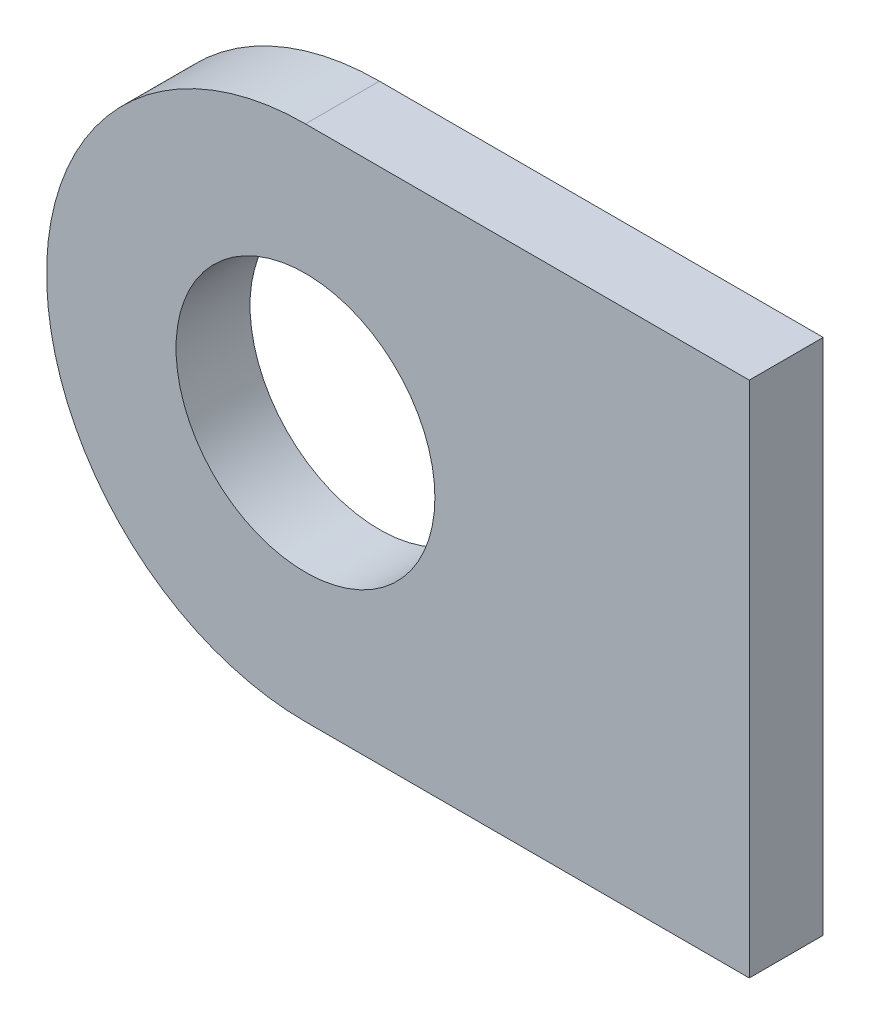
ISO-10303-21;
HEADER;
FILE_DESCRIPTION(('STEP AP214'),'2;1');
FILE_NAME('part.step','',(''),(''),'','','');
FILE_SCHEMA(('AUTOMOTIVE_DESIGN { 1 0 10303 214 1 1 1 1 }'));
ENDSEC;
DATA;
#1=APPLICATION_CONTEXT('core data for automotive mechanical design processes');
#2=APPLICATION_PROTOCOL_DEFINITION('international standard','automotive_design',2000,#1);
#3=PRODUCT_CONTEXT('',#1,'mechanical');
#4=PRODUCT('Part','Part','',(#3));
#5=PRODUCT_RELATED_PRODUCT_CATEGORY('part','',(#4));
#6=PRODUCT_DEFINITION_FORMATION('','',#4);
#7=PRODUCT_DEFINITION_CONTEXT('part definition',#1,'design');
#8=PRODUCT_DEFINITION('design','',#6,#7);
#9=PRODUCT_DEFINITION_SHAPE('','',#8);
#10=(LENGTH_UNIT() NAMED_UNIT(*) SI_UNIT(.MILLI.,.METRE.));
#11=(NAMED_UNIT(*) PLANE_ANGLE_UNIT() SI_UNIT($,.RADIAN.));
#12=(NAMED_UNIT(*) SI_UNIT($,.STERADIAN.) SOLID_ANGLE_UNIT());
#13=UNCERTAINTY_MEASURE_WITH_UNIT(LENGTH_MEASURE(1.E-05),#10,'distance_accuracy_value','');
#14=(GEOMETRIC_REPRESENTATION_CONTEXT(3) GLOBAL_UNCERTAINTY_ASSIGNED_CONTEXT((#13)) GLOBAL_UNIT_ASSIGNED_CONTEXT((#10,
#11,#12)) REPRESENTATION_CONTEXT('',''));
#15=CARTESIAN_POINT('',(0.,0.,0.));
#16=DIRECTION('',(0.,0.,1.));
#17=DIRECTION('',(1.,0.,0.));
#18=AXIS2_PLACEMENT_3D('',#15,#16,#17);
#19=CARTESIAN_POINT('',(-60.,-35.,10.));
#20=DIRECTION('',(0.,0.,-1.));
#21=DIRECTION('',(-1.,0.,0.));
#22=AXIS2_PLACEMENT_3D('',#19,#20,#21);
#23=PLANE('',#22);
#24=DIRECTION('',(0.,1.,0.));
#25=VECTOR('',#24,1.);
#26=CARTESIAN_POINT('',(0.,0.,10.));
#27=LINE('',#26,#25);
#28=CARTESIAN_POINT('',(0.,-70.,10.));
#29=VERTEX_POINT('',#28);
#30=CARTESIAN_POINT('',(0.,0.,10.));
#31=VERTEX_POINT('',#30);
#32=EDGE_CURVE('E84',#29,#31,#27,.T.);
#33=ORIENTED_EDGE('',*,*,#32,.T.);
#34=DIRECTION('',(-1.,0.,0.));
#35=VECTOR('',#34,1.);
#36=CARTESIAN_POINT('',(0.,0.,10.));
#37=LINE('',#36,#35);
#38=CARTESIAN_POINT('',(-60.,0.,10.));
#39=VERTEX_POINT('',#38);
#40=EDGE_CURVE('E79',#31,#39,#37,.T.);
#41=ORIENTED_EDGE('',*,*,#40,.T.);
#42=CARTESIAN_POINT('',(-60.,-35.,10.));
#43=DIRECTION('',(0.,0.,1.));
#44=DIRECTION('',(-1.,0.,0.));
#45=AXIS2_PLACEMENT_3D('',#42,#43,#44);
#46=CIRCLE('',#45,35.);
#47=CARTESIAN_POINT('',(-60.,-70.,10.));
#48=VERTEX_POINT('',#47);
#49=EDGE_CURVE('E82',#39,#48,#46,.T.);
#50=ORIENTED_EDGE('',*,*,#49,.T.);
#51=DIRECTION('',(1.,0.,0.));
#52=VECTOR('',#51,1.);
#53=CARTESIAN_POINT('',(0.,-70.,10.));
#54=LINE('',#53,#52);
#55=EDGE_CURVE('E49',#48,#29,#54,.T.);
#56=ORIENTED_EDGE('',*,*,#55,.T.);
#57=EDGE_LOOP('',(#33,#41,#50,#56));
#58=FACE_BOUND('',#57,.T.);
#59=CARTESIAN_POINT('',(-60.,-35.,10.));
#60=DIRECTION('',(0.,0.,1.));
#61=DIRECTION('',(1.,0.,0.));
#62=AXIS2_PLACEMENT_3D('',#59,#60,#61);
#63=CIRCLE('',#62,17.5);
#64=CARTESIAN_POINT('',(-42.5,-35.,10.));
#65=VERTEX_POINT('',#64);
#66=EDGE_CURVE('E99',#65,#65,#63,.T.);
#67=ORIENTED_EDGE('',*,*,#66,.F.);
#68=EDGE_LOOP('',(#67));
#69=FACE_BOUND('',#68,.T.);
#70=ADVANCED_FACE('F32',(#58,#69),#23,.F.);
#71=CARTESIAN_POINT('',(-60.,-35.,0.));
#72=DIRECTION('',(0.,0.,-1.));
#73=DIRECTION('',(-1.,0.,0.));
#74=AXIS2_PLACEMENT_3D('',#71,#72,#73);
#75=PLANE('',#74);
#76=DIRECTION('',(0.,1.,0.));
#77=VECTOR('',#76,1.);
#78=CARTESIAN_POINT('',(0.,0.,0.));
#79=LINE('',#78,#77);
#80=CARTESIAN_POINT('',(0.,-70.,0.));
#81=VERTEX_POINT('',#80);
#82=CARTESIAN_POINT('',(0.,0.,0.));
#83=VERTEX_POINT('',#82);
#84=EDGE_CURVE('E96',#81,#83,#79,.T.);
#85=ORIENTED_EDGE('',*,*,#84,.F.);
#86=DIRECTION('',(1.,0.,0.));
#87=VECTOR('',#86,1.);
#88=CARTESIAN_POINT('',(0.,-70.,0.));
#89=LINE('',#88,#87);
#90=CARTESIAN_POINT('',(-60.,-70.,0.));
#91=VERTEX_POINT('',#90);
#92=EDGE_CURVE('E72',#91,#81,#89,.T.);
#93=ORIENTED_EDGE('',*,*,#92,.F.);
#94=CARTESIAN_POINT('',(-60.,-35.,0.));
#95=DIRECTION('',(0.,0.,1.));
#96=DIRECTION('',(-1.,0.,0.));
#97=AXIS2_PLACEMENT_3D('',#94,#95,#96);
#98=CIRCLE('',#97,35.);
#99=CARTESIAN_POINT('',(-60.,0.,0.));
#100=VERTEX_POINT('',#99);
#101=EDGE_CURVE('E66',#100,#91,#98,.T.);
#102=ORIENTED_EDGE('',*,*,#101,.F.);
#103=DIRECTION('',(-1.,0.,0.));
#104=VECTOR('',#103,1.);
#105=CARTESIAN_POINT('',(0.,0.,0.));
#106=LINE('',#105,#104);
#107=EDGE_CURVE('E88',#83,#100,#106,.T.);
#108=ORIENTED_EDGE('',*,*,#107,.F.);
#109=EDGE_LOOP('',(#85,#93,#102,#108));
#110=FACE_BOUND('',#109,.T.);
#111=CARTESIAN_POINT('',(-60.,-35.,0.));
#112=DIRECTION('',(0.,0.,1.));
#113=DIRECTION('',(1.,0.,0.));
#114=AXIS2_PLACEMENT_3D('',#111,#112,#113);
#115=CIRCLE('',#114,17.5);
#116=CARTESIAN_POINT('',(-42.5,-35.,0.));
#117=VERTEX_POINT('',#116);
#118=EDGE_CURVE('E111',#117,#117,#115,.T.);
#119=ORIENTED_EDGE('',*,*,#118,.T.);
#120=EDGE_LOOP('',(#119));
#121=FACE_BOUND('',#120,.T.);
#122=ADVANCED_FACE('F107',(#110,#121),#75,.T.);
#123=CARTESIAN_POINT('',(0.,0.,10.));
#124=DIRECTION('',(-1.,0.,0.));
#125=DIRECTION('',(0.,-1.,0.));
#126=AXIS2_PLACEMENT_3D('',#123,#124,#125);
#127=PLANE('',#126);
#128=ORIENTED_EDGE('',*,*,#84,.T.);
#129=DIRECTION('',(0.,0.,-1.));
#130=VECTOR('',#129,1.);
#131=CARTESIAN_POINT('',(0.,0.,10.));
#132=LINE('',#131,#130);
#133=EDGE_CURVE('E11',#31,#83,#132,.T.);
#134=ORIENTED_EDGE('',*,*,#133,.F.);
#135=ORIENTED_EDGE('',*,*,#32,.F.);
#136=DIRECTION('',(0.,0.,-1.));
#137=VECTOR('',#136,1.);
#138=CARTESIAN_POINT('',(0.,-70.,10.));
#139=LINE('',#138,#137);
#140=EDGE_CURVE('E92',#29,#81,#139,.T.);
#141=ORIENTED_EDGE('',*,*,#140,.T.);
#142=EDGE_LOOP('',(#128,#134,#135,#141));
#143=FACE_BOUND('',#142,.T.);
#144=ADVANCED_FACE('F34',(#143),#127,.F.);
#145=CARTESIAN_POINT('',(0.,0.,10.));
#146=DIRECTION('',(0.,-1.,0.));
#147=DIRECTION('',(1.,0.,0.));
#148=AXIS2_PLACEMENT_3D('',#145,#146,#147);
#149=PLANE('',#148);
#150=ORIENTED_EDGE('',*,*,#107,.T.);
#151=DIRECTION('',(0.,0.,-1.));
#152=VECTOR('',#151,1.);
#153=CARTESIAN_POINT('',(-60.,0.,10.));
#154=LINE('',#153,#152);
#155=EDGE_CURVE('E41',#39,#100,#154,.T.);
#156=ORIENTED_EDGE('',*,*,#155,.F.);
#157=ORIENTED_EDGE('',*,*,#40,.F.);
#158=ORIENTED_EDGE('',*,*,#133,.T.);
#159=EDGE_LOOP('',(#150,#156,#157,#158));
#160=FACE_BOUND('',#159,.T.);
#161=ADVANCED_FACE('F87',(#160),#149,.F.);
#162=CARTESIAN_POINT('',(-60.,-35.,10.));
#163=DIRECTION('',(0.,0.,-1.));
#164=DIRECTION('',(-1.,0.,0.));
#165=AXIS2_PLACEMENT_3D('',#162,#163,#164);
#166=CYLINDRICAL_SURFACE('',#165,35.);
#167=ORIENTED_EDGE('',*,*,#101,.T.);
#168=DIRECTION('',(0.,0.,-1.));
#169=VECTOR('',#168,1.);
#170=CARTESIAN_POINT('',(-60.,-70.,10.));
#171=LINE('',#170,#169);
#172=EDGE_CURVE('E89',#48,#91,#171,.T.);
#173=ORIENTED_EDGE('',*,*,#172,.F.);
#174=ORIENTED_EDGE('',*,*,#49,.F.);
#175=ORIENTED_EDGE('',*,*,#155,.T.);
#176=EDGE_LOOP('',(#167,#173,#174,#175));
#177=FACE_BOUND('',#176,.T.);
#178=ADVANCED_FACE('F90',(#177),#166,.T.);
#179=CARTESIAN_POINT('',(0.,-70.,10.));
#180=DIRECTION('',(0.,1.,0.));
#181=DIRECTION('',(0.,0.,1.));
#182=AXIS2_PLACEMENT_3D('',#179,#180,#181);
#183=PLANE('',#182);
#184=ORIENTED_EDGE('',*,*,#92,.T.);
#185=ORIENTED_EDGE('',*,*,#140,.F.);
#186=ORIENTED_EDGE('',*,*,#55,.F.);
#187=ORIENTED_EDGE('',*,*,#172,.T.);
#188=EDGE_LOOP('',(#184,#185,#186,#187));
#189=FACE_BOUND('',#188,.T.);
#190=ADVANCED_FACE('F104',(#189),#183,.F.);
#191=CARTESIAN_POINT('',(-60.,-35.,10.));
#192=DIRECTION('',(0.,0.,-1.));
#193=DIRECTION('',(-1.,0.,0.));
#194=AXIS2_PLACEMENT_3D('',#191,#192,#193);
#195=CYLINDRICAL_SURFACE('',#194,17.5);
#196=ORIENTED_EDGE('',*,*,#66,.T.);
#197=EDGE_LOOP('',(#196));
#198=FACE_BOUND('',#197,.T.);
#199=ORIENTED_EDGE('',*,*,#118,.F.);
#200=EDGE_LOOP('',(#199));
#201=FACE_BOUND('',#200,.T.);
#202=ADVANCED_FACE('F117',(#198,#201),#195,.F.);
#203=CLOSED_SHELL('',(#70,#122,#144,#161,#178,#190,#202));
#204=MANIFOLD_SOLID_BREP('B2',#203);
#205=ADVANCED_BREP_SHAPE_REPRESENTATION('',(#18,#204),#14);
#206=SHAPE_DEFINITION_REPRESENTATION(#9,#205);
ENDSEC;
END-ISO-10303-21;
